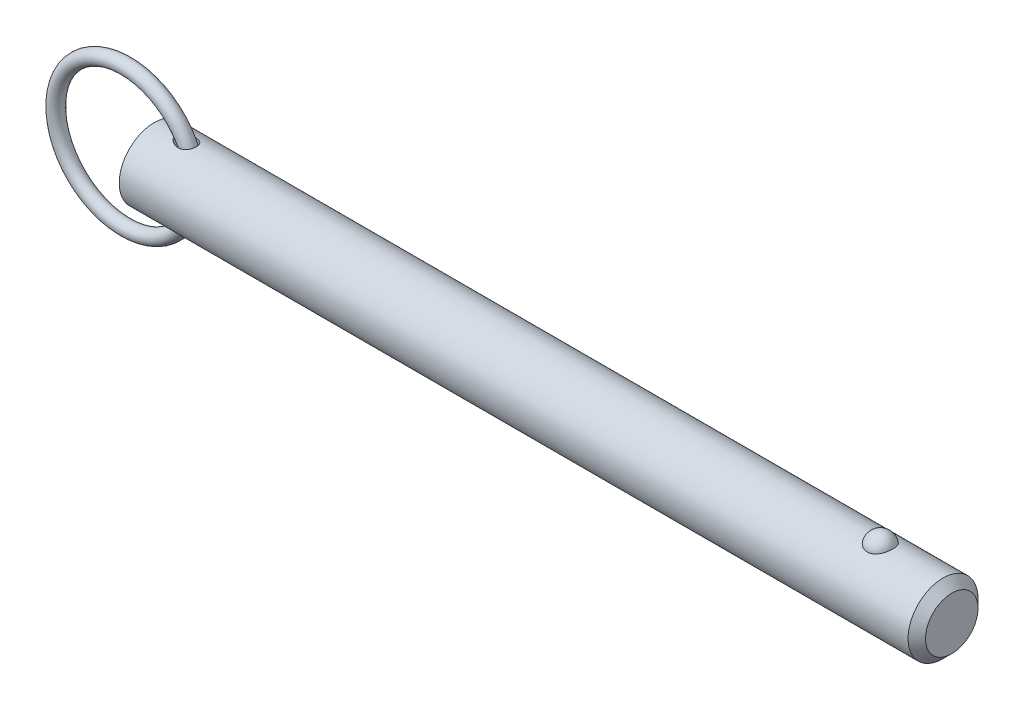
ISO-10303-21;
HEADER;
FILE_DESCRIPTION(('STEP AP214'),'2;1');
FILE_NAME('part.step','',(''),(''),'','','');
FILE_SCHEMA(('AUTOMOTIVE_DESIGN { 1 0 10303 214 1 1 1 1 }'));
ENDSEC;
DATA;
#1=APPLICATION_CONTEXT('core data for automotive mechanical design processes');
#2=APPLICATION_PROTOCOL_DEFINITION('international standard','automotive_design',2000,#1);
#3=PRODUCT_CONTEXT('',#1,'mechanical');
#4=PRODUCT('Part','Part','',(#3));
#5=PRODUCT_RELATED_PRODUCT_CATEGORY('part','',(#4));
#6=PRODUCT_DEFINITION_FORMATION('','',#4);
#7=PRODUCT_DEFINITION_CONTEXT('part definition',#1,'design');
#8=PRODUCT_DEFINITION('design','',#6,#7);
#9=PRODUCT_DEFINITION_SHAPE('','',#8);
#10=(LENGTH_UNIT() NAMED_UNIT(*) SI_UNIT(.MILLI.,.METRE.));
#11=(NAMED_UNIT(*) PLANE_ANGLE_UNIT() SI_UNIT($,.RADIAN.));
#12=(NAMED_UNIT(*) SI_UNIT($,.STERADIAN.) SOLID_ANGLE_UNIT());
#13=UNCERTAINTY_MEASURE_WITH_UNIT(LENGTH_MEASURE(1.E-05),#10,'distance_accuracy_value','');
#14=(GEOMETRIC_REPRESENTATION_CONTEXT(3) GLOBAL_UNCERTAINTY_ASSIGNED_CONTEXT((#13)) GLOBAL_UNIT_ASSIGNED_CONTEXT((#10,
#11,#12)) REPRESENTATION_CONTEXT('',''));
#15=CARTESIAN_POINT('',(0.,0.,0.));
#16=DIRECTION('',(0.,0.,1.));
#17=DIRECTION('',(1.,0.,0.));
#18=AXIS2_PLACEMENT_3D('',#15,#16,#17);
#19=CARTESIAN_POINT('',(-6.46799987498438,0.,0.));
#20=DIRECTION('',(0.,0.,1.));
#21=DIRECTION('',(1.,0.,0.));
#22=AXIS2_PLACEMENT_3D('',#19,#20,#21);
#23=TOROIDAL_SURFACE('',#22,15.875,1.588);
#24=CARTESIAN_POINT('',(10.9950001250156,0.,0.));
#25=VERTEX_POINT('',#24);
#26=VERTEX_LOOP('',#25);
#27=FACE_BOUND('',#26,.T.);
#28=ADVANCED_FACE('P0_F12',(#27),#23,.T.);
#29=CLOSED_SHELL('',(#28));
#30=MANIFOLD_SOLID_BREP('P0_B1',#29);
#31=CARTESIAN_POINT('',(0.,0.,0.));
#32=DIRECTION('',(1.,0.,0.));
#33=DIRECTION('',(0.,0.,-1.));
#34=AXIS2_PLACEMENT_3D('',#31,#32,#33);
#35=CYLINDRICAL_SURFACE('',#34,7.94);
#36=CARTESIAN_POINT('',(5.37881269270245,7.8641200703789,-1.0950869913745));
#37=CARTESIAN_POINT('',(5.49078530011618,7.84653010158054,-1.22142628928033));
#38=CARTESIAN_POINT('',(5.61742164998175,7.82766483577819,-1.33478448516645));
#39=CARTESIAN_POINT('',(5.82155225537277,7.80005811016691,-1.48501770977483));
#40=CARTESIAN_POINT('',(5.89211597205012,7.79095331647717,-1.53186949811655));
#41=CARTESIAN_POINT('',(6.03726296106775,7.77331484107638,-1.61899652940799));
#42=CARTESIAN_POINT('',(6.11184478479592,7.76478095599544,-1.65927412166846));
#43=CARTESIAN_POINT('',(6.31831542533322,7.74290334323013,-1.75933205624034));
#44=CARTESIAN_POINT('',(6.45343253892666,7.73042593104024,-1.81276183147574));
#45=CARTESIAN_POINT('',(6.73017339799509,7.70966096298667,-1.89912673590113));
#46=CARTESIAN_POINT('',(6.87179099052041,7.70136953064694,-1.93208083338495));
#47=CARTESIAN_POINT('',(7.17522096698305,7.6896684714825,-1.97820987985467));
#48=CARTESIAN_POINT('',(7.33750100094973,7.68691980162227,-1.98871513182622));
#49=CARTESIAN_POINT('',(7.57994245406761,7.68880305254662,-1.98137951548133));
#50=CARTESIAN_POINT('',(7.66059155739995,7.69043175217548,-1.97508575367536));
#51=CARTESIAN_POINT('',(7.82077465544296,7.69570110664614,-1.95445819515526));
#52=CARTESIAN_POINT('',(7.9003091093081,7.69934090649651,-1.94012781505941));
#53=CARTESIAN_POINT('',(8.09280087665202,7.71066069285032,-1.89475688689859));
#54=CARTESIAN_POINT('',(8.20465204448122,7.71942251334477,-1.85909462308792));
#55=CARTESIAN_POINT('',(8.42059371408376,7.74035594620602,-1.7699066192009));
#56=CARTESIAN_POINT('',(8.52468939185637,7.75252525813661,-1.7163929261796));
#57=CARTESIAN_POINT('',(8.72211003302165,7.77903750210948,-1.59192358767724));
#58=CARTESIAN_POINT('',(8.81539818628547,7.79338749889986,-1.52091076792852));
#59=CARTESIAN_POINT('',(8.98759177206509,7.8225086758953,-1.36321590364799));
#60=CARTESIAN_POINT('',(9.06649712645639,7.83727985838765,-1.27653377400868));
#61=CARTESIAN_POINT('',(9.20311499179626,7.86453692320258,-1.09567667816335));
#62=CARTESIAN_POINT('',(9.26180839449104,7.8771064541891,-1.00225329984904));
#63=CARTESIAN_POINT('',(9.36257622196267,7.89954213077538,-0.8065472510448));
#64=CARTESIAN_POINT('',(9.40465301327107,7.9094086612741,-0.704265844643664));
#65=CARTESIAN_POINT('',(9.47062404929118,7.92520709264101,-0.495461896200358));
#66=CARTESIAN_POINT('',(9.49478817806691,7.9311972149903,-0.389028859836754));
#67=CARTESIAN_POINT('',(9.52544004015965,7.93883641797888,-0.173494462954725));
#68=CARTESIAN_POINT('',(9.5319278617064,7.94048552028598,-0.0643931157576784));
#69=CARTESIAN_POINT('',(9.52707996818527,7.93926454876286,0.153487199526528));
#70=CARTESIAN_POINT('',(9.51572796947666,7.93639034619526,0.26226578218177));
#71=CARTESIAN_POINT('',(9.47542322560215,7.92642470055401,0.476313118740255));
#72=CARTESIAN_POINT('',(9.44647056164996,7.91933327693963,0.581581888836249));
#73=CARTESIAN_POINT('',(9.3716401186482,7.90170355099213,0.785602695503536));
#74=CARTESIAN_POINT('',(9.32576415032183,7.89116561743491,0.884355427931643));
#75=CARTESIAN_POINT('',(9.21823065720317,7.8677977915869,1.07254831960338));
#76=CARTESIAN_POINT('',(9.15657431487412,7.85496807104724,1.16198917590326));
#77=CARTESIAN_POINT('',(9.01919194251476,7.82843688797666,1.32903649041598));
#78=CARTESIAN_POINT('',(8.94347744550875,7.81473614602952,1.40665255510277));
#79=CARTESIAN_POINT('',(8.78012086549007,7.7879321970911,1.5481977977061));
#80=CARTESIAN_POINT('',(8.69247914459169,7.77482897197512,1.61212739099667));
#81=CARTESIAN_POINT('',(8.50642314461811,7.75037063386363,1.72592270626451));
#82=CARTESIAN_POINT('',(8.40786430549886,7.73904540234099,1.77555777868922));
#83=CARTESIAN_POINT('',(8.2039870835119,7.71943979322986,1.85894844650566));
#84=CARTESIAN_POINT('',(8.0986670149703,7.7111601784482,1.89270006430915));
#85=CARTESIAN_POINT('',(7.87703213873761,7.69782475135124,1.94625652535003));
#86=CARTESIAN_POINT('',(7.76044899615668,7.69301557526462,1.96500324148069));
#87=CARTESIAN_POINT('',(7.52574256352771,7.68770484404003,1.98567257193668));
#88=CARTESIAN_POINT('',(7.40761868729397,7.68720497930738,1.98758858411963));
#89=CARTESIAN_POINT('',(7.15639592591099,7.69044495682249,1.97502233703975));
#90=CARTESIAN_POINT('',(7.02341871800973,7.69476380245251,1.9583009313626));
#91=CARTESIAN_POINT('',(6.7612589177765,7.70776394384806,1.90648094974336));
#92=CARTESIAN_POINT('',(6.6320804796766,7.71644984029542,1.87136299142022));
#93=CARTESIAN_POINT('',(6.35978215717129,7.73875442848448,1.77707737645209));
#94=CARTESIAN_POINT('',(6.2177212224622,7.75293863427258,1.71496895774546));
#95=CARTESIAN_POINT('',(5.94559201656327,7.78383102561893,1.56880760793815));
#96=CARTESIAN_POINT('',(5.81552062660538,7.80053855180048,1.48476040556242));
#97=CARTESIAN_POINT('',(5.60081087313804,7.83035955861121,1.31701356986));
#98=CARTESIAN_POINT('',(5.51265224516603,7.84340226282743,1.23780647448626));
#99=CARTESIAN_POINT('',(5.34976240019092,7.86852524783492,1.06647953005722));
#100=CARTESIAN_POINT('',(5.27500719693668,7.88060722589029,0.974383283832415));
#101=CARTESIAN_POINT('',(5.15877594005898,7.89990441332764,0.800548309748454));
#102=CARTESIAN_POINT('',(5.11360209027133,7.90759876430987,0.721348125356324));
#103=CARTESIAN_POINT('',(5.03655060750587,7.92090267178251,0.556518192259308));
#104=CARTESIAN_POINT('',(5.00466157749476,7.92651401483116,0.470894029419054));
#105=CARTESIAN_POINT('',(4.95653766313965,7.93503671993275,0.294356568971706));
#106=CARTESIAN_POINT('',(4.94043621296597,7.93792505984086,0.203404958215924));
#107=CARTESIAN_POINT('',(4.92605720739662,7.94050250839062,0.0200631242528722));
#108=CARTESIAN_POINT('',(4.92776929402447,7.9401934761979,-0.072326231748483));
#109=CARTESIAN_POINT('',(4.94742735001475,7.93667454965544,-0.24325091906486));
#110=CARTESIAN_POINT('',(4.96327131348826,7.93384031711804,-0.32204819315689));
#111=CARTESIAN_POINT('',(5.00707570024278,7.92609115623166,-0.47605810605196));
#112=CARTESIAN_POINT('',(5.0350396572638,7.92117562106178,-0.551269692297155));
#113=CARTESIAN_POINT('',(5.10737112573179,7.90866290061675,-0.70999547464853));
#114=CARTESIAN_POINT('',(5.15379379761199,7.90074105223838,-0.792541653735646));
#115=CARTESIAN_POINT('',(5.2582083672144,7.88338732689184,-0.949781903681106));
#116=CARTESIAN_POINT('',(5.31621941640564,7.87395295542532,-1.02446265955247));
#117=CARTESIAN_POINT('',(5.37881269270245,7.8641200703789,-1.0950869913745));
#118=B_SPLINE_CURVE_WITH_KNOTS('',3,(#36,#37,#38,#39,#40,#41,#42,#43,#44,#45,#46,#47,#48,#49,
#50,#51,#52,#53,#54,#55,#56,#57,#58,#59,#60,#61,#62,#63,#64,#65,#66,#67,#68,#69,#70,#71,#72,#73,
#74,#75,#76,#77,#78,#79,#80,#81,#82,#83,#84,#85,#86,#87,#88,#89,#90,#91,#92,#93,#94,#95,#96,#97,
#98,#99,#100,#101,#102,#103,#104,#105,#106,#107,#108,#109,#110,#111,#112,#113,#114,#115,#116,
#117),.UNSPECIFIED.,.T.,.F.,(4,2,2,2,2,2,2,2,2,2,2,2,2,2,2,2,2,2,2,2,2,2,2,2,2,2,2,2,2,2,2,2,2,
2,2,2,2,2,2,2,4),(0.,0.508599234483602,0.763935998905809,1.01918131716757,1.45492798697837,
1.89027038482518,2.37502798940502,2.61739702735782,2.8596631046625,3.21120678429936,
3.56251370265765,3.91498401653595,4.26745624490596,4.59897839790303,4.93045331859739,
5.2568264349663,5.58319792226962,5.909867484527,6.23653553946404,6.56316865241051,
6.88977729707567,7.21611917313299,7.54245114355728,7.87378632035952,8.20520442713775,
8.55832700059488,8.91158808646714,9.31234018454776,9.71351536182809,10.1786231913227,
10.6436096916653,11.0001264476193,11.3559986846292,11.6294791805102,11.9027245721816,
12.1782599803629,12.4536351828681,12.693828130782,12.9340911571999,13.2179277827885,
13.5022374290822),.UNSPECIFIED.);
#119=CARTESIAN_POINT('',(5.37881269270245,7.8641200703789,-1.0950869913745));
#120=VERTEX_POINT('',#119);
#121=EDGE_CURVE('P1_E40',#120,#120,#118,.T.);
#122=ORIENTED_EDGE('',*,*,#121,.T.);
#123=EDGE_LOOP('',(#122));
#124=FACE_BOUND('',#123,.T.);
#125=CARTESIAN_POINT('',(178.995,0.,0.));
#126=DIRECTION('',(1.,0.,0.));
#127=DIRECTION('',(0.,0.,-1.));
#128=AXIS2_PLACEMENT_3D('',#125,#126,#127);
#129=CIRCLE('',#128,7.94);
#130=CARTESIAN_POINT('',(178.995,0.,-7.94));
#131=VERTEX_POINT('',#130);
#132=EDGE_CURVE('P1_E25',#131,#131,#129,.T.);
#133=ORIENTED_EDGE('',*,*,#132,.F.);
#134=EDGE_LOOP('',(#133));
#135=FACE_BOUND('',#134,.T.);
#136=CARTESIAN_POINT('',(0.,0.,0.));
#137=DIRECTION('',(1.,0.,0.));
#138=DIRECTION('',(0.,0.,-1.));
#139=AXIS2_PLACEMENT_3D('',#136,#137,#138);
#140=CIRCLE('',#139,7.94);
#141=CARTESIAN_POINT('',(0.,0.,-7.94));
#142=VERTEX_POINT('',#141);
#143=EDGE_CURVE('P1_E9',#142,#142,#140,.T.);
#144=ORIENTED_EDGE('',*,*,#143,.T.);
#145=EDGE_LOOP('',(#144));
#146=FACE_BOUND('',#145,.T.);
#147=CARTESIAN_POINT('',(164.764907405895,7.37767842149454,2.93486986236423));
#148=CARTESIAN_POINT('',(164.612749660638,7.3776732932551,2.93487505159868));
#149=CARTESIAN_POINT('',(164.460632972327,7.38258419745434,2.92262454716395));
#150=CARTESIAN_POINT('',(164.160928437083,7.40163229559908,2.87404196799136));
#151=CARTESIAN_POINT('',(164.013339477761,7.41576720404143,2.83771585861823));
#152=CARTESIAN_POINT('',(163.727018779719,7.45161576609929,2.74218769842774));
#153=CARTESIAN_POINT('',(163.588274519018,7.47331841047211,2.68301886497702));
#154=CARTESIAN_POINT('',(163.322882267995,7.52194082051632,2.54350967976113));
#155=CARTESIAN_POINT('',(163.196236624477,7.54886159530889,2.46316523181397));
#156=CARTESIAN_POINT('',(162.954534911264,7.60594671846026,2.28090375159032));
#157=CARTESIAN_POINT('',(162.839906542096,7.63618114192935,2.1784421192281));
#158=CARTESIAN_POINT('',(162.628878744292,7.69614046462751,1.95608495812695));
#159=CARTESIAN_POINT('',(162.532482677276,7.72586526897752,1.83618622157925));
#160=CARTESIAN_POINT('',(162.355938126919,7.78314821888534,1.57628086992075));
#161=CARTESIAN_POINT('',(162.276707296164,7.81055035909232,1.43561546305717));
#162=CARTESIAN_POINT('',(162.141797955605,7.85879631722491,1.142363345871));
#163=CARTESIAN_POINT('',(162.086121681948,7.87963951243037,0.989775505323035));
#164=CARTESIAN_POINT('',(161.99881215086,7.91289645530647,0.674619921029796));
#165=CARTESIAN_POINT('',(161.96753090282,7.92518652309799,0.511941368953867));
#166=CARTESIAN_POINT('',(161.930975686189,7.93958930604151,0.18324773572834));
#167=CARTESIAN_POINT('',(161.925701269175,7.94170219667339,0.017232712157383));
#168=CARTESIAN_POINT('',(161.941231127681,7.93554931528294,-0.31267286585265));
#169=CARTESIAN_POINT('',(161.961925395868,7.92732732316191,-0.476569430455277));
#170=CARTESIAN_POINT('',(162.02878655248,7.90141534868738,-0.798305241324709));
#171=CARTESIAN_POINT('',(162.074953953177,7.88372517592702,-0.956144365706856));
#172=CARTESIAN_POINT('',(162.191898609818,7.84066230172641,-1.26152073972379));
#173=CARTESIAN_POINT('',(162.262704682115,7.81528060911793,-1.40904568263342));
#174=CARTESIAN_POINT('',(162.427478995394,7.75948672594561,-1.68950598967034));
#175=CARTESIAN_POINT('',(162.521448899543,7.72907417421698,-1.82244030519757));
#176=CARTESIAN_POINT('',(162.730839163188,7.66640424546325,-2.07032792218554));
#177=CARTESIAN_POINT('',(162.846315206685,7.63414223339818,-2.18523308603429));
#178=CARTESIAN_POINT('',(163.0959006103,7.57149681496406,-2.39329737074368));
#179=CARTESIAN_POINT('',(163.230008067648,7.54111321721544,-2.48645870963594));
#180=CARTESIAN_POINT('',(163.510111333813,7.48650742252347,-2.64628132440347));
#181=CARTESIAN_POINT('',(163.655760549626,7.46215900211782,-2.71350554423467));
#182=CARTESIAN_POINT('',(163.957425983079,7.42171253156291,-2.82226614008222));
#183=CARTESIAN_POINT('',(164.113438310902,7.40561140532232,-2.86381209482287));
#184=CARTESIAN_POINT('',(164.422970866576,7.3842679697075,-2.9183907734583));
#185=CARTESIAN_POINT('',(164.576222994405,7.37852109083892,-2.93275024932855));
#186=CARTESIAN_POINT('',(164.883070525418,7.37700973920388,-2.93655208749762));
#187=CARTESIAN_POINT('',(165.036665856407,7.38124333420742,-2.92599927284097));
#188=CARTESIAN_POINT('',(165.334990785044,7.39890635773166,-2.88102897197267));
#189=CARTESIAN_POINT('',(165.479848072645,7.41205491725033,-2.84733999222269));
#190=CARTESIAN_POINT('',(165.76164329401,7.445801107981,-2.75788206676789));
#191=CARTESIAN_POINT('',(165.898580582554,7.46639934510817,-2.70211132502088));
#192=CARTESIAN_POINT('',(166.164061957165,7.51339098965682,-2.56858908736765));
#193=CARTESIAN_POINT('',(166.292354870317,7.53990200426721,-2.4903806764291));
#194=CARTESIAN_POINT('',(166.534244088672,7.59569503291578,-2.31462737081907));
#195=CARTESIAN_POINT('',(166.647837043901,7.6249776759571,-2.21707808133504));
#196=CARTESIAN_POINT('',(166.86322156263,7.68489473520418,-1.99982049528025));
#197=CARTESIAN_POINT('',(166.964148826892,7.71552419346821,-1.87925337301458));
#198=CARTESIAN_POINT('',(167.145186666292,7.77353016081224,-1.6226882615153));
#199=CARTESIAN_POINT('',(167.225293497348,7.80090608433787,-1.48668750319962));
#200=CARTESIAN_POINT('',(167.365361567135,7.85047992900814,-1.1981841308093));
#201=CARTESIAN_POINT('',(167.424587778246,7.87248183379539,-1.04529016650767));
#202=CARTESIAN_POINT('',(167.517982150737,7.90785114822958,-0.731080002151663));
#203=CARTESIAN_POINT('',(167.552149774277,7.92121837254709,-0.56976362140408));
#204=CARTESIAN_POINT('',(167.594795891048,7.93797834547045,-0.242812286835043));
#205=CARTESIAN_POINT('',(167.603204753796,7.94134405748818,-0.0771668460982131));
#206=CARTESIAN_POINT('',(167.593962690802,7.93767937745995,0.253276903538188));
#207=CARTESIAN_POINT('',(167.576312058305,7.93064910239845,0.418075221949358));
#208=CARTESIAN_POINT('',(167.515424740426,7.90695571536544,0.741525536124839));
#209=CARTESIAN_POINT('',(167.472281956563,7.8903279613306,0.900197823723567));
#210=CARTESIAN_POINT('',(167.36135358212,7.84916386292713,1.20759654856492));
#211=CARTESIAN_POINT('',(167.29356656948,7.82462706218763,1.35632241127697));
#212=CARTESIAN_POINT('',(167.134371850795,7.7700669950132,1.64032869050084));
#213=CARTESIAN_POINT('',(167.042861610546,7.7400200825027,1.7755471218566));
#214=CARTESIAN_POINT('',(166.838296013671,7.67774175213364,2.0280064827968));
#215=CARTESIAN_POINT('',(166.725241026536,7.64551037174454,2.14524772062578));
#216=CARTESIAN_POINT('',(166.480831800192,7.58265895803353,2.35778002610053));
#217=CARTESIAN_POINT('',(166.349583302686,7.5520309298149,2.45319004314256));
#218=CARTESIAN_POINT('',(166.071601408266,7.49579792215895,2.61999897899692));
#219=CARTESIAN_POINT('',(165.924867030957,7.47019326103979,2.69139637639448));
#220=CARTESIAN_POINT('',(165.612947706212,7.42622216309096,2.8105324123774));
#221=CARTESIAN_POINT('',(165.447220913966,7.40825002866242,2.85700910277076));
#222=CARTESIAN_POINT('',(165.109279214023,7.38398348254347,2.9191685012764));
#223=CARTESIAN_POINT('',(164.93706702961,7.3776842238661,2.93486399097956));
#224=CARTESIAN_POINT('',(164.764907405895,7.37767842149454,2.93486986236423));
#225=B_SPLINE_CURVE_WITH_KNOTS('',3,(#147,#148,#149,#150,#151,#152,#153,#154,#155,#156,#157,
#158,#159,#160,#161,#162,#163,#164,#165,#166,#167,#168,#169,#170,#171,#172,#173,#174,#175,#176,
#177,#178,#179,#180,#181,#182,#183,#184,#185,#186,#187,#188,#189,#190,#191,#192,#193,#194,#195,
#196,#197,#198,#199,#200,#201,#202,#203,#204,#205,#206,#207,#208,#209,#210,#211,#212,#213,#214,
#215,#216,#217,#218,#219,#220,#221,#222,#223,#224),.UNSPECIFIED.,.T.,.F.,(4,2,2,2,2,2,2,2,2,2,2,
2,2,2,2,2,2,2,2,2,2,2,2,2,2,2,2,2,2,2,2,2,2,2,2,2,2,2,4),(0.,0.455841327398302,
0.911569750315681,1.36663794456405,1.82179423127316,2.28978983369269,2.75787163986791,
3.24685368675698,3.73588214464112,4.23184282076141,4.72779494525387,5.22165321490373,
5.71552141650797,6.20996917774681,6.7044524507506,7.20023431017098,7.69596557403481,
8.18023418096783,8.66432203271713,9.1241069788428,9.58380291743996,10.0296503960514,
10.4755341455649,10.9312349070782,11.3870393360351,11.8654416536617,12.3439299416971,
12.8378875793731,13.3318558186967,13.8271581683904,14.3224549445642,14.8159385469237,
15.3094506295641,15.8051323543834,16.3008055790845,16.7937101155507,17.2866458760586,
17.8026240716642,18.3183879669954),.UNSPECIFIED.);
#226=CARTESIAN_POINT('',(164.764907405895,7.37767842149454,2.93486986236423));
#227=VERTEX_POINT('',#226);
#228=EDGE_CURVE('P1_E34',#227,#227,#225,.T.);
#229=ORIENTED_EDGE('',*,*,#228,.T.);
#230=EDGE_LOOP('',(#229));
#231=FACE_BOUND('',#230,.T.);
#232=CARTESIAN_POINT('',(5.37881269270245,-7.8641200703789,-1.0950869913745));
#233=CARTESIAN_POINT('',(5.31532711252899,-7.87409326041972,-1.02345575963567));
#234=CARTESIAN_POINT('',(5.25654962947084,-7.88365715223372,-0.947641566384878));
#235=CARTESIAN_POINT('',(5.15093536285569,-7.90122221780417,-0.787865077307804));
#236=CARTESIAN_POINT('',(5.10408931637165,-7.90922460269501,-0.703909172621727));
#237=CARTESIAN_POINT('',(5.02499142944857,-7.92292057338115,-0.527991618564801));
#238=CARTESIAN_POINT('',(4.99290048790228,-7.92858863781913,-0.435954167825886));
#239=CARTESIAN_POINT('',(4.94718343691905,-7.93670712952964,-0.247266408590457));
#240=CARTESIAN_POINT('',(4.93353142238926,-7.93916207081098,-0.150622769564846));
#241=CARTESIAN_POINT('',(4.92669426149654,-7.94038957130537,0.0306459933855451));
#242=CARTESIAN_POINT('',(4.93105622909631,-7.93960347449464,0.115182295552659));
#243=CARTESIAN_POINT('',(4.95441758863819,-7.93542535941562,0.282133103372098));
#244=CARTESIAN_POINT('',(4.97342060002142,-7.93203269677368,0.364547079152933));
#245=CARTESIAN_POINT('',(5.02337664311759,-7.92322764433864,0.521528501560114));
#246=CARTESIAN_POINT('',(5.05377582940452,-7.91790920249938,0.596281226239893));
#247=CARTESIAN_POINT('',(5.1246872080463,-7.90571364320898,0.740640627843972));
#248=CARTESIAN_POINT('',(5.16520358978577,-7.89883588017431,0.81024515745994));
#249=CARTESIAN_POINT('',(5.27792634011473,-7.88012470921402,0.978620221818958));
#250=CARTESIAN_POINT('',(5.35563200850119,-7.86757912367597,1.07363778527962));
#251=CARTESIAN_POINT('',(5.52523836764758,-7.84150676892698,1.24994147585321));
#252=CARTESIAN_POINT('',(5.61717506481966,-7.82797755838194,1.33119164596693));
#253=CARTESIAN_POINT('',(5.8391371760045,-7.79742756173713,1.50104748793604));
#254=CARTESIAN_POINT('',(5.9725742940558,-7.78050347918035,1.58521567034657));
#255=CARTESIAN_POINT('',(6.25160600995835,-7.74942135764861,1.73078109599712));
#256=CARTESIAN_POINT('',(6.39720857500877,-7.73526515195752,1.79216327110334));
#257=CARTESIAN_POINT('',(6.69793322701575,-7.7116170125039,1.89134478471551));
#258=CARTESIAN_POINT('',(6.85312134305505,-7.70216275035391,1.92895428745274));
#259=CARTESIAN_POINT('',(7.16781951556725,-7.68988337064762,1.97736316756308));
#260=CARTESIAN_POINT('',(7.32732244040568,-7.68704791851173,1.98820434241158));
#261=CARTESIAN_POINT('',(7.61290770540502,-7.68890797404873,1.98097687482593));
#262=CARTESIAN_POINT('',(7.73913797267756,-7.69217875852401,1.96837928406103));
#263=CARTESIAN_POINT('',(7.98774248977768,-7.70364253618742,1.92303262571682));
#264=CARTESIAN_POINT('',(8.11011880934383,-7.71183283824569,1.89029457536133));
#265=CARTESIAN_POINT('',(8.34766306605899,-7.73253074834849,1.80375920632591));
#266=CARTESIAN_POINT('',(8.46278682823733,-7.74506226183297,1.74984505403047));
#267=CARTESIAN_POINT('',(8.6806268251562,-7.77294147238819,1.62149891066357));
#268=CARTESIAN_POINT('',(8.78334736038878,-7.78828818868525,1.54707406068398));
#269=CARTESIAN_POINT('',(8.96275951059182,-7.81808719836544,1.38814746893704));
#270=CARTESIAN_POINT('',(9.0410292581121,-7.83247448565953,1.30540890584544));
#271=CARTESIAN_POINT('',(9.18176824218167,-7.86008608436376,1.12727331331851));
#272=CARTESIAN_POINT('',(9.24424163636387,-7.87331070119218,1.03187962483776));
#273=CARTESIAN_POINT('',(9.34924815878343,-7.89649032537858,0.835684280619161));
#274=CARTESIAN_POINT('',(9.39252490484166,-7.90656172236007,0.735293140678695));
#275=CARTESIAN_POINT('',(9.46188913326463,-7.92307290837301,0.528458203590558));
#276=CARTESIAN_POINT('',(9.48797767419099,-7.92951292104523,0.422014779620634));
#277=CARTESIAN_POINT('',(9.5222867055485,-7.93804067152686,0.20658939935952));
#278=CARTESIAN_POINT('',(9.53058328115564,-7.94014694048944,0.0976202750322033));
#279=CARTESIAN_POINT('',(9.52935292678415,-7.93983698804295,-0.120212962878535));
#280=CARTESIAN_POINT('',(9.51982577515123,-7.93742071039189,-0.229077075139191));
#281=CARTESIAN_POINT('',(9.48313466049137,-7.92831916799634,-0.44375138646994));
#282=CARTESIAN_POINT('',(9.45594838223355,-7.92162850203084,-0.549557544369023));
#283=CARTESIAN_POINT('',(9.3845465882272,-7.90469917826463,-0.754954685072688));
#284=CARTESIAN_POINT('',(9.34033171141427,-7.89446065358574,-0.854545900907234));
#285=CARTESIAN_POINT('',(9.23602927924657,-7.87157146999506,-1.04456732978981));
#286=CARTESIAN_POINT('',(9.17596171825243,-7.85892385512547,-1.13500888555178));
#287=CARTESIAN_POINT('',(9.04153430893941,-7.83259746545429,-1.30436780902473));
#288=CARTESIAN_POINT('',(8.96717562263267,-7.81891877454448,-1.38328611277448));
#289=CARTESIAN_POINT('',(8.80603455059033,-7.79196869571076,-1.52782923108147));
#290=CARTESIAN_POINT('',(8.71921490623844,-7.77869867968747,-1.59341269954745));
#291=CARTESIAN_POINT('',(8.53589430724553,-7.7539823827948,-1.7096493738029));
#292=CARTESIAN_POINT('',(8.439392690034,-7.74253622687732,-1.76030155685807));
#293=CARTESIAN_POINT('',(8.23614706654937,-7.72219212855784,-1.84754820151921));
#294=CARTESIAN_POINT('',(8.12916866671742,-7.71339202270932,-1.88361685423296));
#295=CARTESIAN_POINT('',(7.91082287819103,-7.69955300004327,-1.93940887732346));
#296=CARTESIAN_POINT('',(7.79945379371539,-7.69451555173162,-1.95912586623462));
#297=CARTESIAN_POINT('',(7.56409927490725,-7.6881073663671,-1.98413612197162));
#298=CARTESIAN_POINT('',(7.43993744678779,-7.68713944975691,-1.98784574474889));
#299=CARTESIAN_POINT('',(7.19239878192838,-7.68969629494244,-1.97792309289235));
#300=CARTESIAN_POINT('',(7.06902225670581,-7.69322274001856,-1.96428432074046));
#301=CARTESIAN_POINT('',(6.80624991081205,-7.70498367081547,-1.91768089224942));
#302=CARTESIAN_POINT('',(6.66736121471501,-7.71386737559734,-1.88203087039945));
#303=CARTESIAN_POINT('',(6.39625444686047,-7.73551250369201,-1.79098714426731));
#304=CARTESIAN_POINT('',(6.26404857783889,-7.74828074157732,-1.73555871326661));
#305=CARTESIAN_POINT('',(6.06559048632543,-7.77003865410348,-1.63446133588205));
#306=CARTESIAN_POINT('',(5.99591479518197,-7.77821880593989,-1.59522999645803));
#307=CARTESIAN_POINT('',(5.86025875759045,-7.79503524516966,-1.51091846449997));
#308=CARTESIAN_POINT('',(5.79427944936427,-7.8036716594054,-1.46583664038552));
#309=CARTESIAN_POINT('',(5.60322733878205,-7.82978128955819,-1.3219827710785));
#310=CARTESIAN_POINT('',(5.48449649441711,-7.84751780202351,-1.21433077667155));
#311=CARTESIAN_POINT('',(5.37881269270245,-7.8641200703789,-1.0950869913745));
#312=B_SPLINE_CURVE_WITH_KNOTS('',3,(#232,#233,#234,#235,#236,#237,#238,#239,#240,#241,#242,
#243,#244,#245,#246,#247,#248,#249,#250,#251,#252,#253,#254,#255,#256,#257,#258,#259,#260,#261,
#262,#263,#264,#265,#266,#267,#268,#269,#270,#271,#272,#273,#274,#275,#276,#277,#278,#279,#280,
#281,#282,#283,#284,#285,#286,#287,#288,#289,#290,#291,#292,#293,#294,#295,#296,#297,#298,#299,
#300,#301,#302,#303,#304,#305,#306,#307,#308,#309,#310,#311),.UNSPECIFIED.,.T.,.F.,(4,2,2,2,2,2,
2,2,2,2,2,2,2,2,2,2,2,2,2,2,2,2,2,2,2,2,2,2,2,2,2,2,2,2,2,2,2,2,2,4),(0.,0.288363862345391,
0.576503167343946,0.867714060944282,1.15851540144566,1.41111828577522,1.66378363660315,
1.90549406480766,2.1473047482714,2.51540453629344,2.88445136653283,3.35805159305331,
3.83196445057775,4.30961543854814,4.78652012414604,5.16565662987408,5.54458592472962,
5.92563591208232,6.30655339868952,6.64920782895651,6.99177197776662,7.31956587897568,
7.64733959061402,7.97370879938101,8.30008206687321,8.62686856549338,8.95364280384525,
9.28000684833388,9.60634436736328,9.93367879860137,10.261035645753,10.59932199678,
10.9377403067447,11.308967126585,11.6803330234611,12.1096921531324,12.5398088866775,
12.7806650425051,13.0215885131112,13.5016249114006),.UNSPECIFIED.);
#313=CARTESIAN_POINT('',(5.37881269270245,-7.8641200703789,-1.0950869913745));
#314=VERTEX_POINT('',#313);
#315=EDGE_CURVE('P1_E17',#314,#314,#312,.T.);
#316=ORIENTED_EDGE('',*,*,#315,.T.);
#317=EDGE_LOOP('',(#316));
#318=FACE_BOUND('',#317,.T.);
#319=ADVANCED_FACE('P1_F13',(#124,#135,#146,#231,#318),#35,.T.);
#320=CARTESIAN_POINT('',(0.,0.,0.));
#321=DIRECTION('',(-1.,0.,0.));
#322=DIRECTION('',(0.,0.,1.));
#323=AXIS2_PLACEMENT_3D('',#320,#321,#322);
#324=PLANE('',#323);
#325=ORIENTED_EDGE('',*,*,#143,.F.);
#326=EDGE_LOOP('',(#325));
#327=FACE_BOUND('',#326,.T.);
#328=ADVANCED_FACE('P1_F15',(#327),#324,.T.);
#329=CARTESIAN_POINT('',(180.98,0.,0.));
#330=DIRECTION('',(-1.,0.,0.));
#331=DIRECTION('',(0.,0.,1.));
#332=AXIS2_PLACEMENT_3D('',#329,#330,#331);
#333=CONICAL_SURFACE('',#332,5.95500000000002,0.785398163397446);
#334=ORIENTED_EDGE('',*,*,#132,.T.);
#335=EDGE_LOOP('',(#334));
#336=FACE_BOUND('',#335,.T.);
#337=CARTESIAN_POINT('',(180.98,0.,0.));
#338=DIRECTION('',(1.,0.,0.));
#339=DIRECTION('',(0.,0.,-1.));
#340=AXIS2_PLACEMENT_3D('',#337,#338,#339);
#341=CIRCLE('',#340,5.95500000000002);
#342=CARTESIAN_POINT('',(180.98,0.,-5.95500000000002));
#343=VERTEX_POINT('',#342);
#344=EDGE_CURVE('P1_E30',#343,#343,#341,.T.);
#345=ORIENTED_EDGE('',*,*,#344,.F.);
#346=EDGE_LOOP('',(#345));
#347=FACE_BOUND('',#346,.T.);
#348=ADVANCED_FACE('P1_F55',(#336,#347),#333,.T.);
#349=CARTESIAN_POINT('',(180.98,5.95500000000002,0.));
#350=DIRECTION('',(1.,0.,0.));
#351=DIRECTION('',(0.,0.,-1.));
#352=AXIS2_PLACEMENT_3D('',#349,#350,#351);
#353=PLANE('',#352);
#354=ORIENTED_EDGE('',*,*,#344,.T.);
#355=EDGE_LOOP('',(#354));
#356=FACE_BOUND('',#355,.T.);
#357=ADVANCED_FACE('P1_F51',(#356),#353,.T.);
#358=CARTESIAN_POINT('',(164.764907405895,7.146,0.));
#359=DIRECTION('',(-1.,0.,0.));
#360=DIRECTION('',(0.,1.,0.));
#361=AXIS2_PLACEMENT_3D('',#358,#359,#360);
#362=SPHERICAL_SURFACE('',#361,2.944);
#363=ORIENTED_EDGE('',*,*,#228,.F.);
#364=EDGE_LOOP('',(#363));
#365=FACE_BOUND('',#364,.T.);
#366=ADVANCED_FACE('P1_F46',(#365),#362,.T.);
#367=CARTESIAN_POINT('',(-6.46799987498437,0.,0.));
#368=DIRECTION('',(0.,0.,1.));
#369=DIRECTION('',(1.,0.,0.));
#370=AXIS2_PLACEMENT_3D('',#367,#368,#369);
#371=TOROIDAL_SURFACE('',#370,15.875,1.985);
#372=ORIENTED_EDGE('',*,*,#315,.F.);
#373=EDGE_LOOP('',(#372));
#374=FACE_BOUND('',#373,.T.);
#375=ORIENTED_EDGE('',*,*,#121,.F.);
#376=EDGE_LOOP('',(#375));
#377=FACE_BOUND('',#376,.T.);
#378=ADVANCED_FACE('P1_F50',(#374,#377),#371,.F.);
#379=CLOSED_SHELL('',(#319,#328,#348,#357,#366,#378));
#380=MANIFOLD_SOLID_BREP('P1_B1',#379);
#381=ADVANCED_BREP_SHAPE_REPRESENTATION('',(#18,#30,#380),#14);
#382=SHAPE_DEFINITION_REPRESENTATION(#9,#381);
ENDSEC;
END-ISO-10303-21;
